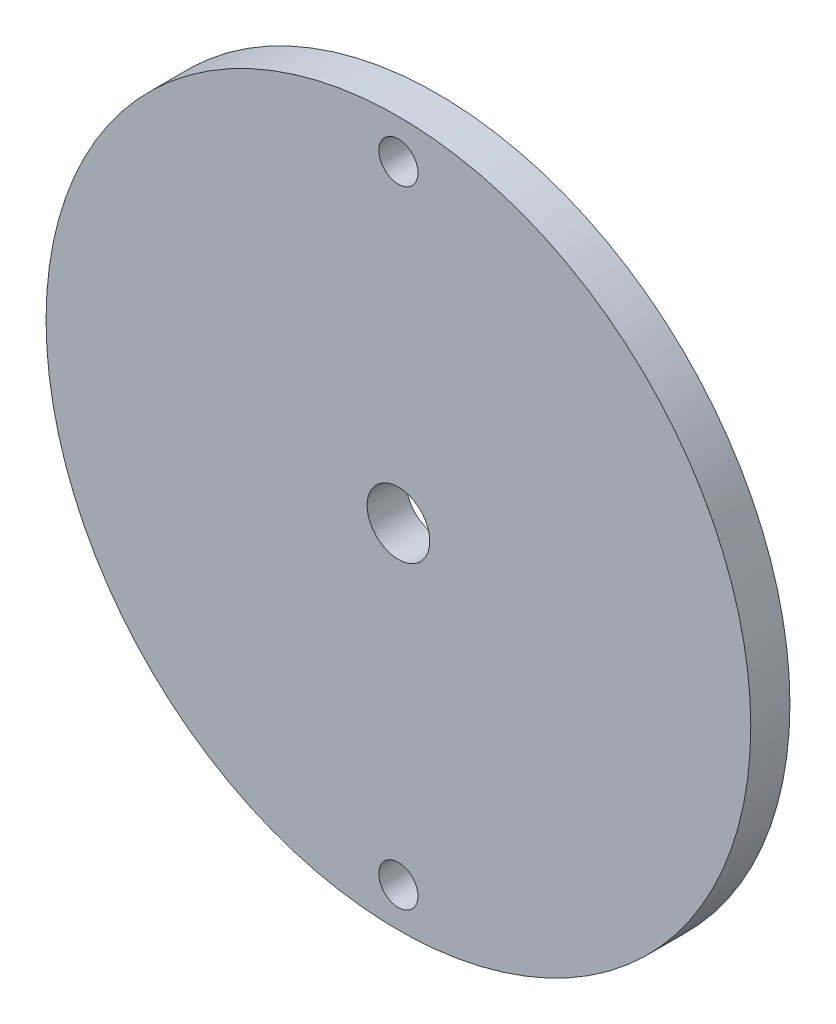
ISO-10303-21;
HEADER;
FILE_DESCRIPTION(('STEP AP214'),'2;1');
FILE_NAME('part.step','',(''),(''),'','','');
FILE_SCHEMA(('AUTOMOTIVE_DESIGN { 1 0 10303 214 1 1 1 1 }'));
ENDSEC;
DATA;
#1=APPLICATION_CONTEXT('core data for automotive mechanical design processes');
#2=APPLICATION_PROTOCOL_DEFINITION('international standard','automotive_design',2000,#1);
#3=PRODUCT_CONTEXT('',#1,'mechanical');
#4=PRODUCT('Part','Part','',(#3));
#5=PRODUCT_RELATED_PRODUCT_CATEGORY('part','',(#4));
#6=PRODUCT_DEFINITION_FORMATION('','',#4);
#7=PRODUCT_DEFINITION_CONTEXT('part definition',#1,'design');
#8=PRODUCT_DEFINITION('design','',#6,#7);
#9=PRODUCT_DEFINITION_SHAPE('','',#8);
#10=(LENGTH_UNIT() NAMED_UNIT(*) SI_UNIT(.MILLI.,.METRE.));
#11=(NAMED_UNIT(*) PLANE_ANGLE_UNIT() SI_UNIT($,.RADIAN.));
#12=(NAMED_UNIT(*) SI_UNIT($,.STERADIAN.) SOLID_ANGLE_UNIT());
#13=UNCERTAINTY_MEASURE_WITH_UNIT(LENGTH_MEASURE(1.E-05),#10,'distance_accuracy_value','');
#14=(GEOMETRIC_REPRESENTATION_CONTEXT(3) GLOBAL_UNCERTAINTY_ASSIGNED_CONTEXT((#13)) GLOBAL_UNIT_ASSIGNED_CONTEXT((#10,
#11,#12)) REPRESENTATION_CONTEXT('',''));
#15=CARTESIAN_POINT('',(0.,0.,0.));
#16=DIRECTION('',(0.,0.,1.));
#17=DIRECTION('',(1.,0.,0.));
#18=AXIS2_PLACEMENT_3D('',#15,#16,#17);
#19=CARTESIAN_POINT('',(0.,0.,35.));
#20=DIRECTION('',(0.,0.,-1.));
#21=DIRECTION('',(-1.,0.,0.));
#22=AXIS2_PLACEMENT_3D('',#19,#20,#21);
#23=CYLINDRICAL_SURFACE('',#22,45.);
#24=CARTESIAN_POINT('',(0.,0.,35.));
#25=DIRECTION('',(0.,0.,-1.));
#26=DIRECTION('',(-1.,0.,0.));
#27=AXIS2_PLACEMENT_3D('',#24,#25,#26);
#28=CIRCLE('',#27,45.);
#29=CARTESIAN_POINT('',(-45.,0.,35.));
#30=VERTEX_POINT('',#29);
#31=EDGE_CURVE('E10',#30,#30,#28,.T.);
#32=ORIENTED_EDGE('',*,*,#31,.T.);
#33=EDGE_LOOP('',(#32));
#34=FACE_BOUND('',#33,.T.);
#35=CARTESIAN_POINT('',(0.,0.,30.));
#36=DIRECTION('',(0.,0.,-1.));
#37=DIRECTION('',(-1.,0.,0.));
#38=AXIS2_PLACEMENT_3D('',#35,#36,#37);
#39=CIRCLE('',#38,45.);
#40=CARTESIAN_POINT('',(-45.,0.,30.));
#41=VERTEX_POINT('',#40);
#42=EDGE_CURVE('E36',#41,#41,#39,.T.);
#43=ORIENTED_EDGE('',*,*,#42,.F.);
#44=EDGE_LOOP('',(#43));
#45=FACE_BOUND('',#44,.T.);
#46=ADVANCED_FACE('F33',(#34,#45),#23,.T.);
#47=CARTESIAN_POINT('',(0.,0.,35.));
#48=DIRECTION('',(0.,0.,-1.));
#49=DIRECTION('',(-1.,0.,0.));
#50=AXIS2_PLACEMENT_3D('',#47,#48,#49);
#51=PLANE('',#50);
#52=CARTESIAN_POINT('',(0.,0.,35.));
#53=DIRECTION('',(0.,0.,-1.));
#54=DIRECTION('',(-1.,0.,0.));
#55=AXIS2_PLACEMENT_3D('',#52,#53,#54);
#56=CIRCLE('',#55,4.);
#57=CARTESIAN_POINT('',(-4.00000000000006,0.,35.));
#58=VERTEX_POINT('',#57);
#59=EDGE_CURVE('E56',#58,#58,#56,.T.);
#60=ORIENTED_EDGE('',*,*,#59,.T.);
#61=EDGE_LOOP('',(#60));
#62=FACE_BOUND('',#61,.T.);
#63=CARTESIAN_POINT('',(0.,-40.,35.));
#64=DIRECTION('',(0.,0.,-1.));
#65=DIRECTION('',(-1.,0.,0.));
#66=AXIS2_PLACEMENT_3D('',#63,#64,#65);
#67=CIRCLE('',#66,2.5);
#68=CARTESIAN_POINT('',(-2.5,-40.,35.));
#69=VERTEX_POINT('',#68);
#70=EDGE_CURVE('E50',#69,#69,#67,.F.);
#71=ORIENTED_EDGE('',*,*,#70,.F.);
#72=EDGE_LOOP('',(#71));
#73=FACE_BOUND('',#72,.T.);
#74=CARTESIAN_POINT('',(0.,40.,35.));
#75=DIRECTION('',(0.,0.,-1.));
#76=DIRECTION('',(-1.,0.,0.));
#77=AXIS2_PLACEMENT_3D('',#74,#75,#76);
#78=CIRCLE('',#77,2.5);
#79=CARTESIAN_POINT('',(-2.5,40.,35.));
#80=VERTEX_POINT('',#79);
#81=EDGE_CURVE('E43',#80,#80,#78,.T.);
#82=ORIENTED_EDGE('',*,*,#81,.T.);
#83=EDGE_LOOP('',(#82));
#84=FACE_BOUND('',#83,.T.);
#85=ORIENTED_EDGE('',*,*,#31,.F.);
#86=EDGE_LOOP('',(#85));
#87=FACE_BOUND('',#86,.T.);
#88=ADVANCED_FACE('F70',(#62,#73,#84,#87),#51,.F.);
#89=CARTESIAN_POINT('',(0.,0.,30.));
#90=DIRECTION('',(0.,0.,-1.));
#91=DIRECTION('',(-1.,0.,0.));
#92=AXIS2_PLACEMENT_3D('',#89,#90,#91);
#93=PLANE('',#92);
#94=CARTESIAN_POINT('',(0.,-40.,30.));
#95=DIRECTION('',(0.,0.,1.));
#96=DIRECTION('',(-1.,0.,0.));
#97=AXIS2_PLACEMENT_3D('',#94,#95,#96);
#98=CIRCLE('',#97,2.5);
#99=CARTESIAN_POINT('',(-2.5,-40.,30.));
#100=VERTEX_POINT('',#99);
#101=EDGE_CURVE('E53',#100,#100,#98,.T.);
#102=ORIENTED_EDGE('',*,*,#101,.T.);
#103=EDGE_LOOP('',(#102));
#104=FACE_BOUND('',#103,.T.);
#105=CARTESIAN_POINT('',(0.,40.,30.));
#106=DIRECTION('',(0.,0.,-1.));
#107=DIRECTION('',(-1.,0.,0.));
#108=AXIS2_PLACEMENT_3D('',#105,#106,#107);
#109=CIRCLE('',#108,2.5);
#110=CARTESIAN_POINT('',(-2.5,40.,30.));
#111=VERTEX_POINT('',#110);
#112=EDGE_CURVE('E47',#111,#111,#109,.T.);
#113=ORIENTED_EDGE('',*,*,#112,.F.);
#114=EDGE_LOOP('',(#113));
#115=FACE_BOUND('',#114,.T.);
#116=CARTESIAN_POINT('',(0.,0.,30.));
#117=DIRECTION('',(0.,0.,-1.));
#118=DIRECTION('',(-1.,0.,0.));
#119=AXIS2_PLACEMENT_3D('',#116,#117,#118);
#120=CIRCLE('',#119,4.);
#121=CARTESIAN_POINT('',(-4.00000000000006,0.,30.));
#122=VERTEX_POINT('',#121);
#123=EDGE_CURVE('E59',#122,#122,#120,.T.);
#124=ORIENTED_EDGE('',*,*,#123,.F.);
#125=EDGE_LOOP('',(#124));
#126=FACE_BOUND('',#125,.T.);
#127=ORIENTED_EDGE('',*,*,#42,.T.);
#128=EDGE_LOOP('',(#127));
#129=FACE_BOUND('',#128,.T.);
#130=ADVANCED_FACE('F66',(#104,#115,#126,#129),#93,.T.);
#131=CARTESIAN_POINT('',(0.,40.,130.));
#132=DIRECTION('',(0.,0.,-1.));
#133=DIRECTION('',(-1.,0.,0.));
#134=AXIS2_PLACEMENT_3D('',#131,#132,#133);
#135=CYLINDRICAL_SURFACE('',#134,2.5);
#136=ORIENTED_EDGE('',*,*,#112,.T.);
#137=EDGE_LOOP('',(#136));
#138=FACE_BOUND('',#137,.T.);
#139=ORIENTED_EDGE('',*,*,#81,.F.);
#140=EDGE_LOOP('',(#139));
#141=FACE_BOUND('',#140,.T.);
#142=ADVANCED_FACE('F69',(#138,#141),#135,.F.);
#143=CARTESIAN_POINT('',(0.,-40.,130.));
#144=DIRECTION('',(0.,0.,-1.));
#145=DIRECTION('',(-1.,0.,0.));
#146=AXIS2_PLACEMENT_3D('',#143,#144,#145);
#147=CYLINDRICAL_SURFACE('',#146,2.5);
#148=ORIENTED_EDGE('',*,*,#101,.F.);
#149=EDGE_LOOP('',(#148));
#150=FACE_BOUND('',#149,.T.);
#151=ORIENTED_EDGE('',*,*,#70,.T.);
#152=EDGE_LOOP('',(#151));
#153=FACE_BOUND('',#152,.T.);
#154=ADVANCED_FACE('F86',(#150,#153),#147,.F.);
#155=CARTESIAN_POINT('',(0.,0.,88.));
#156=DIRECTION('',(0.,0.,-1.));
#157=DIRECTION('',(-1.,0.,0.));
#158=AXIS2_PLACEMENT_3D('',#155,#156,#157);
#159=CYLINDRICAL_SURFACE('',#158,4.);
#160=ORIENTED_EDGE('',*,*,#123,.T.);
#161=EDGE_LOOP('',(#160));
#162=FACE_BOUND('',#161,.T.);
#163=ORIENTED_EDGE('',*,*,#59,.F.);
#164=EDGE_LOOP('',(#163));
#165=FACE_BOUND('',#164,.T.);
#166=ADVANCED_FACE('F63',(#162,#165),#159,.F.);
#167=CLOSED_SHELL('',(#46,#88,#130,#142,#154,#166));
#168=MANIFOLD_SOLID_BREP('B2',#167);
#169=ADVANCED_BREP_SHAPE_REPRESENTATION('',(#18,#168),#14);
#170=SHAPE_DEFINITION_REPRESENTATION(#9,#169);
ENDSEC;
END-ISO-10303-21;
